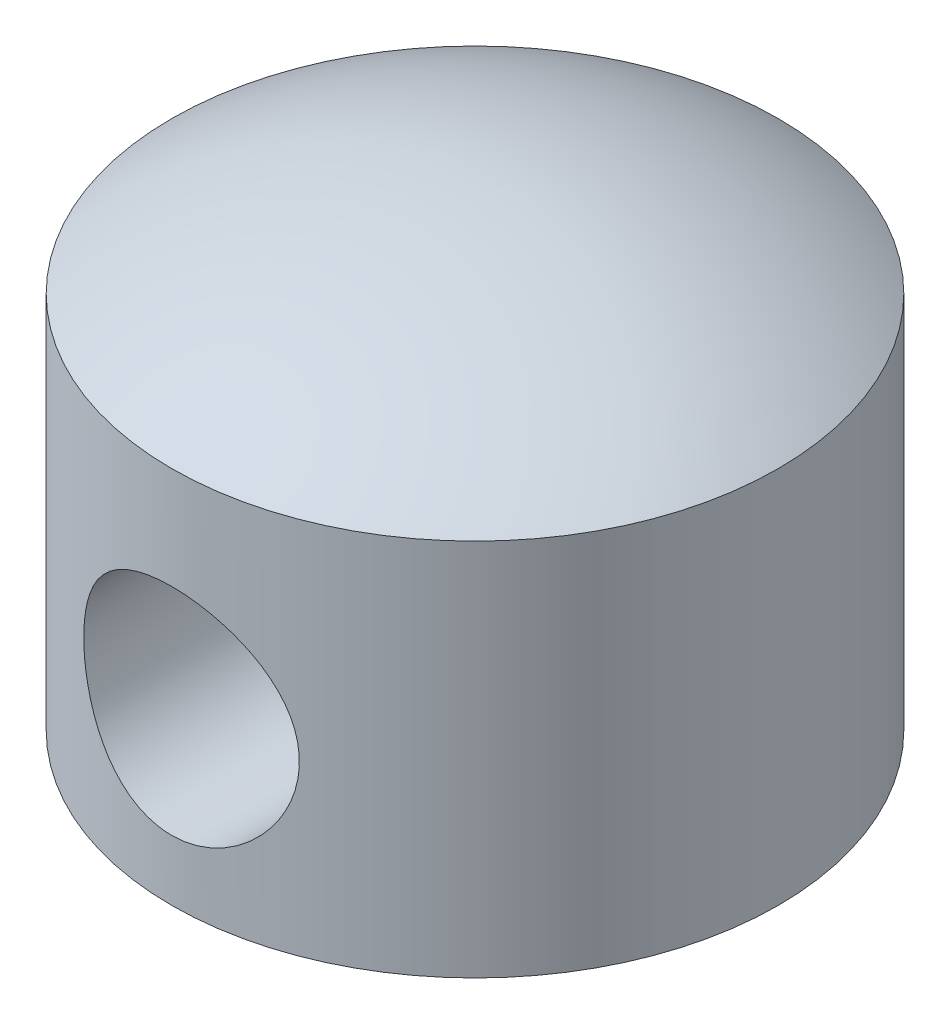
ISO-10303-21;
HEADER;
FILE_DESCRIPTION(('STEP AP214'),'2;1');
FILE_NAME('part.step','',(''),(''),'','','');
FILE_SCHEMA(('AUTOMOTIVE_DESIGN { 1 0 10303 214 1 1 1 1 }'));
ENDSEC;
DATA;
#1=APPLICATION_CONTEXT('core data for automotive mechanical design processes');
#2=APPLICATION_PROTOCOL_DEFINITION('international standard','automotive_design',2000,#1);
#3=PRODUCT_CONTEXT('',#1,'mechanical');
#4=PRODUCT('Part','Part','',(#3));
#5=PRODUCT_RELATED_PRODUCT_CATEGORY('part','',(#4));
#6=PRODUCT_DEFINITION_FORMATION('','',#4);
#7=PRODUCT_DEFINITION_CONTEXT('part definition',#1,'design');
#8=PRODUCT_DEFINITION('design','',#6,#7);
#9=PRODUCT_DEFINITION_SHAPE('','',#8);
#10=(LENGTH_UNIT() NAMED_UNIT(*) SI_UNIT(.MILLI.,.METRE.));
#11=(NAMED_UNIT(*) PLANE_ANGLE_UNIT() SI_UNIT($,.RADIAN.));
#12=(NAMED_UNIT(*) SI_UNIT($,.STERADIAN.) SOLID_ANGLE_UNIT());
#13=UNCERTAINTY_MEASURE_WITH_UNIT(LENGTH_MEASURE(1.E-05),#10,'distance_accuracy_value','');
#14=(GEOMETRIC_REPRESENTATION_CONTEXT(3) GLOBAL_UNCERTAINTY_ASSIGNED_CONTEXT((#13)) GLOBAL_UNIT_ASSIGNED_CONTEXT((#10,
#11,#12)) REPRESENTATION_CONTEXT('',''));
#15=CARTESIAN_POINT('',(0.,0.,0.));
#16=DIRECTION('',(0.,0.,1.));
#17=DIRECTION('',(1.,0.,0.));
#18=AXIS2_PLACEMENT_3D('',#15,#16,#17);
#19=CARTESIAN_POINT('',(0.,32.5,0.));
#20=DIRECTION('',(0.,-1.,0.));
#21=DIRECTION('',(1.,0.,0.));
#22=AXIS2_PLACEMENT_3D('',#19,#20,#21);
#23=PLANE('',#22);
#24=CARTESIAN_POINT('',(0.,32.5,0.));
#25=DIRECTION('',(0.,1.,0.));
#26=DIRECTION('',(0.,0.,-1.));
#27=AXIS2_PLACEMENT_3D('',#24,#25,#26);
#28=CIRCLE('',#27,2.25);
#29=CARTESIAN_POINT('',(0.,32.5,-2.25));
#30=VERTEX_POINT('',#29);
#31=EDGE_CURVE('E211',#30,#30,#28,.T.);
#32=ORIENTED_EDGE('',*,*,#31,.F.);
#33=EDGE_LOOP('',(#32));
#34=FACE_BOUND('',#33,.T.);
#35=ADVANCED_FACE('F16',(#34),#23,.T.);
#36=CARTESIAN_POINT('',(0.,34.5,0.));
#37=DIRECTION('',(0.,-1.,0.));
#38=DIRECTION('',(1.,0.,0.));
#39=AXIS2_PLACEMENT_3D('',#36,#37,#38);
#40=PLANE('',#39);
#41=CARTESIAN_POINT('',(0.,34.5,0.));
#42=DIRECTION('',(0.,-1.,0.));
#43=DIRECTION('',(0.,0.,-1.));
#44=AXIS2_PLACEMENT_3D('',#41,#42,#43);
#45=CIRCLE('',#44,0.86143593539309);
#46=CARTESIAN_POINT('',(-0.278388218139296,34.5,0.815212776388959));
#47=VERTEX_POINT('',#46);
#48=CARTESIAN_POINT('',(-0.278388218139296,34.5,-0.815212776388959));
#49=VERTEX_POINT('',#48);
#50=EDGE_CURVE('E29',#47,#49,#45,.T.);
#51=ORIENTED_EDGE('',*,*,#50,.F.);
#52=DIRECTION('',(0.,0.,-1.));
#53=VECTOR('',#52,1.);
#54=CARTESIAN_POINT('',(-0.278388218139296,34.5,-2.25));
#55=LINE('',#54,#53);
#56=EDGE_CURVE('E219',#47,#49,#55,.T.);
#57=ORIENTED_EDGE('',*,*,#56,.T.);
#58=EDGE_LOOP('',(#51,#57));
#59=FACE_BOUND('',#58,.T.);
#60=ADVANCED_FACE('F247',(#59),#40,.F.);
#61=CARTESIAN_POINT('',(0.,34.5,0.));
#62=DIRECTION('',(0.,-1.,0.));
#63=DIRECTION('',(1.,0.,0.));
#64=AXIS2_PLACEMENT_3D('',#61,#62,#63);
#65=PLANE('',#64);
#66=CARTESIAN_POINT('',(0.,34.5,0.));
#67=DIRECTION('',(0.,-1.,0.));
#68=DIRECTION('',(0.,0.,-1.));
#69=AXIS2_PLACEMENT_3D('',#66,#67,#68);
#70=CIRCLE('',#69,0.86143593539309);
#71=CARTESIAN_POINT('',(0.278388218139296,34.5,-0.815212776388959));
#72=VERTEX_POINT('',#71);
#73=CARTESIAN_POINT('',(0.278388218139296,34.5,0.815212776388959));
#74=VERTEX_POINT('',#73);
#75=EDGE_CURVE('E11',#72,#74,#70,.T.);
#76=ORIENTED_EDGE('',*,*,#75,.F.);
#77=DIRECTION('',(0.,0.,1.));
#78=VECTOR('',#77,1.);
#79=CARTESIAN_POINT('',(0.278388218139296,34.5,-2.25));
#80=LINE('',#79,#78);
#81=EDGE_CURVE('E97',#72,#74,#80,.T.);
#82=ORIENTED_EDGE('',*,*,#81,.T.);
#83=EDGE_LOOP('',(#76,#82));
#84=FACE_BOUND('',#83,.T.);
#85=ADVANCED_FACE('F95',(#84),#65,.F.);
#86=CARTESIAN_POINT('',(0.,-965.002649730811,0.));
#87=DIRECTION('',(0.,-1.,0.));
#88=DIRECTION('',(0.,0.,-1.));
#89=AXIS2_PLACEMENT_3D('',#86,#87,#88);
#90=CONICAL_SURFACE('',#89,1732.05080756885,1.0471975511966);
#91=CARTESIAN_POINT('',(0.,34.9973502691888,0.));
#92=VERTEX_POINT('',#91);
#93=VERTEX_LOOP('',#92);
#94=FACE_BOUND('',#93,.T.);
#95=CARTESIAN_POINT('',(-1.5764251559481E-13,34.5499999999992,0.77483339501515));
#96=CARTESIAN_POINT('',(0.0129203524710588,34.5500008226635,0.774833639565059));
#97=CARTESIAN_POINT('',(0.02584165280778,34.5496870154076,0.775038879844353));
#98=CARTESIAN_POINT('',(0.0513478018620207,34.5484499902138,0.775880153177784));
#99=CARTESIAN_POINT('',(0.0639336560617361,34.5475407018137,0.776506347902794));
#100=CARTESIAN_POINT('',(0.0887435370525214,34.5451581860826,0.778189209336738));
#101=CARTESIAN_POINT('',(0.100969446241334,34.5436977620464,0.779236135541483));
#102=CARTESIAN_POINT('',(0.125037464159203,34.5402596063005,0.781760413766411));
#103=CARTESIAN_POINT('',(0.136882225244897,34.5382934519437,0.783228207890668));
#104=CARTESIAN_POINT('',(0.160170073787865,34.5338897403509,0.786593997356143));
#105=CARTESIAN_POINT('',(0.171616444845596,34.5314624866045,0.788482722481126));
#106=CARTESIAN_POINT('',(0.194093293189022,34.5261820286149,0.792690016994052));
#107=CARTESIAN_POINT('',(0.205127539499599,34.5233378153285,0.794999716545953));
#108=CARTESIAN_POINT('',(0.226769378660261,34.5172676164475,0.800048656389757));
#109=CARTESIAN_POINT('',(0.237381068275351,34.5140493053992,0.802779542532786));
#110=CARTESIAN_POINT('',(0.258170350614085,34.5072753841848,0.808669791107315));
#111=CARTESIAN_POINT('',(0.268352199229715,34.5037261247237,0.8118214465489));
#112=CARTESIAN_POINT('',(0.278388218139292,34.5,0.81521277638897));
#113=B_SPLINE_CURVE_WITH_KNOTS('',3,(#95,#96,#97,#98,#99,#100,#101,#102,#103,#104,#105,#106,
#107,#108,#109,#110,#111,#112),.UNSPECIFIED.,.F.,.F.,(4,2,2,2,2,2,2,2,4),(0.,0.0387569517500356,
0.0766382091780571,0.113688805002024,0.149956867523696,0.185493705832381,0.220353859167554,
0.254595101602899,0.288278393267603),.UNSPECIFIED.);
#114=CARTESIAN_POINT('',(-1.59336871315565E-13,34.5500000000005,0.77483339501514));
#115=VERTEX_POINT('',#114);
#116=EDGE_CURVE('E113',#115,#74,#113,.T.);
#117=ORIENTED_EDGE('',*,*,#116,.F.);
#118=CARTESIAN_POINT('',(-0.278388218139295,34.5,0.81521277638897));
#119=CARTESIAN_POINT('',(-0.268352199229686,34.5037261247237,0.811821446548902));
#120=CARTESIAN_POINT('',(-0.258170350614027,34.5072753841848,0.808669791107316));
#121=CARTESIAN_POINT('',(-0.237381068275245,34.5140493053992,0.802779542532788));
#122=CARTESIAN_POINT('',(-0.226769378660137,34.5172676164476,0.800048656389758));
#123=CARTESIAN_POINT('',(-0.20512753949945,34.5233378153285,0.794999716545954));
#124=CARTESIAN_POINT('',(-0.194093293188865,34.526182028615,0.792690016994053));
#125=CARTESIAN_POINT('',(-0.171616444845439,34.5314624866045,0.788482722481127));
#126=CARTESIAN_POINT('',(-0.160170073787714,34.533889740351,0.786593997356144));
#127=CARTESIAN_POINT('',(-0.136882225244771,34.5382934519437,0.783228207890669));
#128=CARTESIAN_POINT('',(-0.125037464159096,34.5402596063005,0.781760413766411));
#129=CARTESIAN_POINT('',(-0.100969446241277,34.5436977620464,0.779236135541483));
#130=CARTESIAN_POINT('',(-0.0887435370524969,34.5451581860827,0.778189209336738));
#131=CARTESIAN_POINT('',(-0.0639336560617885,34.5475407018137,0.776506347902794));
#132=CARTESIAN_POINT('',(-0.0513478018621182,34.5484499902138,0.775880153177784));
#133=CARTESIAN_POINT('',(-0.02584165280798,34.5496870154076,0.775038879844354));
#134=CARTESIAN_POINT('',(-0.0129203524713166,34.5500008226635,0.774833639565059));
#135=CARTESIAN_POINT('',(-1.5764251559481E-13,34.5499999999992,0.77483339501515));
#136=B_SPLINE_CURVE_WITH_KNOTS('',3,(#118,#119,#120,#121,#122,#123,#124,#125,#126,#127,#128,
#129,#130,#131,#132,#133,#134,#135),.UNSPECIFIED.,.F.,.F.,(4,2,2,2,2,2,2,2,4),(0.,
0.0336832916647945,0.0679245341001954,0.102784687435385,0.138321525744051,0.174589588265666,
0.211640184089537,0.249521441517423,0.288278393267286),.UNSPECIFIED.);
#137=EDGE_CURVE('E121',#47,#115,#136,.T.);
#138=ORIENTED_EDGE('',*,*,#137,.F.);
#139=ORIENTED_EDGE('',*,*,#50,.T.);
#140=CARTESIAN_POINT('',(1.58549001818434E-13,34.5499999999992,-0.77483339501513));
#141=CARTESIAN_POINT('',(-0.0129203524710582,34.5500008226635,-0.774833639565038));
#142=CARTESIAN_POINT('',(-0.0258416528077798,34.5496870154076,-0.775038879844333));
#143=CARTESIAN_POINT('',(-0.0513478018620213,34.5484499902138,-0.775880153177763));
#144=CARTESIAN_POINT('',(-0.063933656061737,34.5475407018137,-0.776506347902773));
#145=CARTESIAN_POINT('',(-0.0887435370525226,34.5451581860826,-0.778189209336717));
#146=CARTESIAN_POINT('',(-0.100969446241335,34.5436977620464,-0.779236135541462));
#147=CARTESIAN_POINT('',(-0.125037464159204,34.5402596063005,-0.781760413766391));
#148=CARTESIAN_POINT('',(-0.136882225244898,34.5382934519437,-0.783228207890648));
#149=CARTESIAN_POINT('',(-0.160170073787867,34.5338897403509,-0.786593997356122));
#150=CARTESIAN_POINT('',(-0.171616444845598,34.5314624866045,-0.788482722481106));
#151=CARTESIAN_POINT('',(-0.194093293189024,34.5261820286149,-0.792690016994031));
#152=CARTESIAN_POINT('',(-0.205127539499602,34.5233378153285,-0.794999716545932));
#153=CARTESIAN_POINT('',(-0.226769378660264,34.5172676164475,-0.800048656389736));
#154=CARTESIAN_POINT('',(-0.237381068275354,34.5140493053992,-0.802779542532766));
#155=CARTESIAN_POINT('',(-0.258170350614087,34.5072753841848,-0.808669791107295));
#156=CARTESIAN_POINT('',(-0.268352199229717,34.5037261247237,-0.81182144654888));
#157=CARTESIAN_POINT('',(-0.278388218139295,34.5,-0.81521277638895));
#158=B_SPLINE_CURVE_WITH_KNOTS('',3,(#140,#141,#142,#143,#144,#145,#146,#147,#148,#149,#150,
#151,#152,#153,#154,#155,#156,#157),.UNSPECIFIED.,.F.,.F.,(4,2,2,2,2,2,2,2,4),(0.,
0.0387569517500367,0.0766382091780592,0.113688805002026,0.149956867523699,0.185493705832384,
0.220353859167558,0.254595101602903,0.288278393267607),.UNSPECIFIED.);
#159=CARTESIAN_POINT('',(1.59431761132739E-13,34.5500000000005,-0.77483339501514));
#160=VERTEX_POINT('',#159);
#161=EDGE_CURVE('E104',#160,#49,#158,.T.);
#162=ORIENTED_EDGE('',*,*,#161,.F.);
#163=CARTESIAN_POINT('',(0.278388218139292,34.5,-0.81521277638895));
#164=CARTESIAN_POINT('',(0.268352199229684,34.5037261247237,-0.811821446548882));
#165=CARTESIAN_POINT('',(0.258170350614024,34.5072753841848,-0.808669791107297));
#166=CARTESIAN_POINT('',(0.237381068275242,34.5140493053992,-0.802779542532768));
#167=CARTESIAN_POINT('',(0.226769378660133,34.5172676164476,-0.800048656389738));
#168=CARTESIAN_POINT('',(0.205127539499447,34.5233378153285,-0.794999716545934));
#169=CARTESIAN_POINT('',(0.194093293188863,34.526182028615,-0.792690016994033));
#170=CARTESIAN_POINT('',(0.171616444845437,34.5314624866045,-0.788482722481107));
#171=CARTESIAN_POINT('',(0.160170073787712,34.533889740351,-0.786593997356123));
#172=CARTESIAN_POINT('',(0.136882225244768,34.5382934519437,-0.783228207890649));
#173=CARTESIAN_POINT('',(0.125037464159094,34.5402596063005,-0.781760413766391));
#174=CARTESIAN_POINT('',(0.100969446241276,34.5436977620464,-0.779236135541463));
#175=CARTESIAN_POINT('',(0.0887435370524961,34.5451581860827,-0.778189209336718));
#176=CARTESIAN_POINT('',(0.0639336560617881,34.5475407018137,-0.776506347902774));
#177=CARTESIAN_POINT('',(0.0513478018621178,34.5484499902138,-0.775880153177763));
#178=CARTESIAN_POINT('',(0.0258416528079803,34.5496870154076,-0.775038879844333));
#179=CARTESIAN_POINT('',(0.0129203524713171,34.5500008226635,-0.774833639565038));
#180=CARTESIAN_POINT('',(1.58549001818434E-13,34.5499999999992,-0.77483339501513));
#181=B_SPLINE_CURVE_WITH_KNOTS('',3,(#163,#164,#165,#166,#167,#168,#169,#170,#171,#172,#173,
#174,#175,#176,#177,#178,#179,#180),.UNSPECIFIED.,.F.,.F.,(4,2,2,2,2,2,2,2,4),(0.,
0.0336832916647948,0.0679245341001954,0.102784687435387,0.138321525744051,0.174589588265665,
0.211640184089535,0.249521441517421,0.288278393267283),.UNSPECIFIED.);
#182=EDGE_CURVE('E100',#72,#160,#181,.T.);
#183=ORIENTED_EDGE('',*,*,#182,.F.);
#184=ORIENTED_EDGE('',*,*,#75,.T.);
#185=EDGE_LOOP('',(#117,#138,#139,#162,#183,#184));
#186=FACE_BOUND('',#185,.T.);
#187=ADVANCED_FACE('F102',(#94,#186),#90,.F.);
#188=CARTESIAN_POINT('',(0.,33.7499999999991,-2.25));
#189=DIRECTION('',(0.,0.,1.));
#190=DIRECTION('',(0.,-1.,0.));
#191=AXIS2_PLACEMENT_3D('',#188,#189,#190);
#192=CYLINDRICAL_SURFACE('',#191,0.8);
#193=ORIENTED_EDGE('',*,*,#137,.T.);
#194=ORIENTED_EDGE('',*,*,#116,.T.);
#195=ORIENTED_EDGE('',*,*,#81,.F.);
#196=ORIENTED_EDGE('',*,*,#182,.T.);
#197=ORIENTED_EDGE('',*,*,#161,.T.);
#198=ORIENTED_EDGE('',*,*,#56,.F.);
#199=EDGE_LOOP('',(#193,#194,#195,#196,#197,#198));
#200=FACE_BOUND('',#199,.T.);
#201=CARTESIAN_POINT('',(0.,32.9499999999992,2.25));
#202=CARTESIAN_POINT('',(0.0125886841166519,32.9499996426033,2.24999993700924));
#203=CARTESIAN_POINT('',(0.02517717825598,32.9502971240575,2.24988822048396));
#204=CARTESIAN_POINT('',(0.0504928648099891,32.9514932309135,2.24944708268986));
#205=CARTESIAN_POINT('',(0.0632196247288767,32.9523999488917,2.24911473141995));
#206=CARTESIAN_POINT('',(0.0887813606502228,32.9548364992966,2.24823237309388));
#207=CARTESIAN_POINT('',(0.10161544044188,32.9563746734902,2.24767945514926));
#208=CARTESIAN_POINT('',(0.127359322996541,32.9600942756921,2.24635596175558));
#209=CARTESIAN_POINT('',(0.140267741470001,32.9622842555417,2.24558249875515));
#210=CARTESIAN_POINT('',(0.166125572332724,32.9673262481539,2.2438177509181));
#211=CARTESIAN_POINT('',(0.179073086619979,32.9701869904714,2.24282360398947));
#212=CARTESIAN_POINT('',(0.204972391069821,32.9765876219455,2.2406180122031));
#213=CARTESIAN_POINT('',(0.217921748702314,32.980136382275,2.23940374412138));
#214=CARTESIAN_POINT('',(0.243785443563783,32.9879280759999,2.23675576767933));
#215=CARTESIAN_POINT('',(0.256696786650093,32.9921799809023,2.23531924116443));
#216=CARTESIAN_POINT('',(0.282445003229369,33.001391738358,2.23223475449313));
#217=CARTESIAN_POINT('',(0.295278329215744,33.0063606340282,2.23058412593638));
#218=CARTESIAN_POINT('',(0.316956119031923,33.0154022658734,2.22757702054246));
#219=CARTESIAN_POINT('',(0.325875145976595,33.0193153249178,2.2262746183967));
#220=CARTESIAN_POINT('',(0.344418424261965,33.0278572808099,2.22343862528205));
#221=CARTESIAN_POINT('',(0.354026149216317,33.0325187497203,2.22189488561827));
#222=CARTESIAN_POINT('',(0.373885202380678,33.0426493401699,2.21857997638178));
#223=CARTESIAN_POINT('',(0.384117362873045,33.048153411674,2.21680080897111));
#224=CARTESIAN_POINT('',(0.405150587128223,33.0600646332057,2.21301196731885));
#225=CARTESIAN_POINT('',(0.415929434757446,33.0665088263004,2.21099535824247));
#226=CARTESIAN_POINT('',(0.43796749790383,33.0803980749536,2.20673102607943));
#227=CARTESIAN_POINT('',(0.449201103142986,33.0878819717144,2.20447737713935));
#228=CARTESIAN_POINT('',(0.472044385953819,33.103948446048,2.19973816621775));
#229=CARTESIAN_POINT('',(0.483624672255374,33.1125712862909,2.1972474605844));
#230=CARTESIAN_POINT('',(0.50704115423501,33.1310123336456,2.19203257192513));
#231=CARTESIAN_POINT('',(0.5188438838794,33.140871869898,2.18930382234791));
#232=CARTESIAN_POINT('',(0.53636712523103,33.1563881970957,2.18510180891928));
#233=CARTESIAN_POINT('',(0.542304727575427,33.1618077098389,2.18365020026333));
#234=CARTESIAN_POINT('',(0.554184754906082,33.1729837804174,2.18068460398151));
#235=CARTESIAN_POINT('',(0.560122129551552,33.1787455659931,2.17917004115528));
#236=CARTESIAN_POINT('',(0.572093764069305,33.1907291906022,2.17606691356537));
#237=CARTESIAN_POINT('',(0.57811915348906,33.1969598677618,2.174478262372));
#238=CARTESIAN_POINT('',(0.589767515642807,33.2094036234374,2.17137143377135));
#239=CARTESIAN_POINT('',(0.59539720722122,33.2156102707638,2.1698526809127));
#240=CARTESIAN_POINT('',(0.606268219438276,33.2279805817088,2.16688075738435));
#241=CARTESIAN_POINT('',(0.61151623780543,33.2341382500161,2.16542714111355));
#242=CARTESIAN_POINT('',(0.621639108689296,33.2463873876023,2.16258684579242));
#243=CARTESIAN_POINT('',(0.62652059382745,33.2524732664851,2.16119964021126));
#244=CARTESIAN_POINT('',(0.640360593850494,33.270255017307,2.15721510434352));
#245=CARTESIAN_POINT('',(0.649090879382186,33.2821342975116,2.15463688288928));
#246=CARTESIAN_POINT('',(0.665223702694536,33.3054082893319,2.14974997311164));
#247=CARTESIAN_POINT('',(0.672676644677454,33.3167670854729,2.14743608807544));
#248=CARTESIAN_POINT('',(0.686386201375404,33.3388695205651,2.14307817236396));
#249=CARTESIAN_POINT('',(0.692690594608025,33.3495823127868,2.1410280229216));
#250=CARTESIAN_POINT('',(0.70423135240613,33.3702828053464,2.13719961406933));
#251=CARTESIAN_POINT('',(0.709512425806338,33.3802442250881,2.13541389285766));
#252=CARTESIAN_POINT('',(0.719129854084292,33.3993513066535,2.13211285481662));
#253=CARTESIAN_POINT('',(0.723507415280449,33.4084746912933,2.13058868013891));
#254=CARTESIAN_POINT('',(0.731434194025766,33.4258329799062,2.12782184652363));
#255=CARTESIAN_POINT('',(0.735020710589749,33.4340489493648,2.12656699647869));
#256=CARTESIAN_POINT('',(0.743787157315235,33.4550903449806,2.12350353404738));
#257=CARTESIAN_POINT('',(0.748779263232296,33.4680045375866,2.1217626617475));
#258=CARTESIAN_POINT('',(0.758018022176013,33.4938858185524,2.11850722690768));
#259=CARTESIAN_POINT('',(0.762275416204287,33.506848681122,2.1169894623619));
#260=CARTESIAN_POINT('',(0.770063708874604,33.5327853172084,2.11419232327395));
#261=CARTESIAN_POINT('',(0.773605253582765,33.5457555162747,2.11290948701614));
#262=CARTESIAN_POINT('',(0.779981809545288,33.5716647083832,2.11057913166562));
#263=CARTESIAN_POINT('',(0.782827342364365,33.584600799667,2.10952813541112));
#264=CARTESIAN_POINT('',(0.787834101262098,33.6104030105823,2.10766234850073));
#265=CARTESIAN_POINT('',(0.790005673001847,33.6232668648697,2.1068440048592));
#266=CARTESIAN_POINT('',(0.793688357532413,33.6488883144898,2.10544336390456));
#267=CARTESIAN_POINT('',(0.795209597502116,33.6616442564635,2.10485745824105));
#268=CARTESIAN_POINT('',(0.797616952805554,33.6870163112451,2.10392183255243));
#269=CARTESIAN_POINT('',(0.798512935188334,33.6996313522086,2.10356844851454));
#270=CARTESIAN_POINT('',(0.799696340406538,33.7246906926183,2.10309781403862));
#271=CARTESIAN_POINT('',(0.799993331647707,33.7371344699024,2.10297685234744));
#272=CARTESIAN_POINT('',(0.800006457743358,33.7620442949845,2.1029713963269));
#273=CARTESIAN_POINT('',(0.799721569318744,33.7745103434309,2.10308731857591));
#274=CARTESIAN_POINT('',(0.798560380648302,33.7996169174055,2.10354916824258));
#275=CARTESIAN_POINT('',(0.797674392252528,33.8122569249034,2.1038988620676));
#276=CARTESIAN_POINT('',(0.795284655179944,33.8376814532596,2.10482822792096));
#277=CARTESIAN_POINT('',(0.793770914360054,33.8504648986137,2.10541161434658));
#278=CARTESIAN_POINT('',(0.790100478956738,33.8761436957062,2.10680838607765));
#279=CARTESIAN_POINT('',(0.787933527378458,33.8890373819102,2.10762542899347));
#280=CARTESIAN_POINT('',(0.782932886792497,33.914901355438,2.10948977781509));
#281=CARTESIAN_POINT('',(0.780088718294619,33.9278693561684,2.11054068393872));
#282=CARTESIAN_POINT('',(0.773711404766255,33.9538441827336,2.11287200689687));
#283=CARTESIAN_POINT('',(0.770167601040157,33.9668480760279,2.11415594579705));
#284=CARTESIAN_POINT('',(0.762370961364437,33.9928535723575,2.11695652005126));
#285=CARTESIAN_POINT('',(0.758107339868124,34.0058515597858,2.11847666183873));
#286=CARTESIAN_POINT('',(0.748851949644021,34.0318042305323,2.12173777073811));
#287=CARTESIAN_POINT('',(0.743849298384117,34.0447546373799,2.12348197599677));
#288=CARTESIAN_POINT('',(0.735071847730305,34.0658320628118,2.12654918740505));
#289=CARTESIAN_POINT('',(0.731486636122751,34.0740486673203,2.12780365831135));
#290=CARTESIAN_POINT('',(0.723558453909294,34.0914174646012,2.13057155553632));
#291=CARTESIAN_POINT('',(0.719177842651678,34.1005505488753,2.13209733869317));
#292=CARTESIAN_POINT('',(0.709549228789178,34.1196857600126,2.13540330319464));
#293=CARTESIAN_POINT('',(0.704259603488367,34.1296653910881,2.13719243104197));
#294=CARTESIAN_POINT('',(0.692695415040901,34.1504102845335,2.1410294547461));
#295=CARTESIAN_POINT('',(0.686375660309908,34.161148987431,2.14308488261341));
#296=CARTESIAN_POINT('',(0.672627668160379,34.183310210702,2.14745515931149));
#297=CARTESIAN_POINT('',(0.665151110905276,34.1947015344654,2.1497761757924));
#298=CARTESIAN_POINT('',(0.648961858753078,34.2180462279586,2.15467917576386));
#299=CARTESIAN_POINT('',(0.640198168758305,34.2299632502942,2.15726639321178));
#300=CARTESIAN_POINT('',(0.626302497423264,34.2478017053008,2.16126512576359));
#301=CARTESIAN_POINT('',(0.621400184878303,34.2539078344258,2.16265752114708));
#302=CARTESIAN_POINT('',(0.611232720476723,34.2661981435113,2.16550866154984));
#303=CARTESIAN_POINT('',(0.605960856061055,34.2723766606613,2.16696793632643));
#304=CARTESIAN_POINT('',(0.595039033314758,34.2847890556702,2.16995163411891));
#305=CARTESIAN_POINT('',(0.589382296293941,34.2910168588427,2.17147650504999));
#306=CARTESIAN_POINT('',(0.5776765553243,34.3035030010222,2.17459605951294));
#307=CARTESIAN_POINT('',(0.571620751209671,34.309754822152,2.1761913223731));
#308=CARTESIAN_POINT('',(0.5596225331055,34.3217436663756,2.17929838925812));
#309=CARTESIAN_POINT('',(0.553690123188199,34.3274906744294,2.18081029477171));
#310=CARTESIAN_POINT('',(0.541819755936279,34.3386388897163,2.18377078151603));
#311=CARTESIAN_POINT('',(0.535886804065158,34.344045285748,2.18521993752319));
#312=CARTESIAN_POINT('',(0.518375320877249,34.35952643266,2.18941533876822));
#313=CARTESIAN_POINT('',(0.5065803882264,34.3693643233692,2.19213980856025));
#314=CARTESIAN_POINT('',(0.483176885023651,34.3877679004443,2.19734697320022));
#315=CARTESIAN_POINT('',(0.471601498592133,34.3963746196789,2.19983423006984));
#316=CARTESIAN_POINT('',(0.448764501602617,34.4124138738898,2.20456738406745));
#317=CARTESIAN_POINT('',(0.437532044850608,34.4198863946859,2.20681841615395));
#318=CARTESIAN_POINT('',(0.415492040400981,34.4337571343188,2.21107835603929));
#319=CARTESIAN_POINT('',(0.404709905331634,34.4401939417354,2.21309317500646));
#320=CARTESIAN_POINT('',(0.383665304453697,34.4520938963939,2.21687929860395));
#321=CARTESIAN_POINT('',(0.373424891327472,34.4575938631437,2.21865751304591));
#322=CARTESIAN_POINT('',(0.353544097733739,34.4677190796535,2.22197134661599));
#323=CARTESIAN_POINT('',(0.343922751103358,34.4723790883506,2.22351492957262));
#324=CARTESIAN_POINT('',(0.325346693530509,34.4809203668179,2.22635158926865));
#325=CARTESIAN_POINT('',(0.316408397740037,34.4848340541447,2.22765474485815));
#326=CARTESIAN_POINT('',(0.294736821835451,34.4938535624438,2.23065587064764));
#327=CARTESIAN_POINT('',(0.281930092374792,34.4988017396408,2.23230048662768));
#328=CARTESIAN_POINT('',(0.256234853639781,34.5079757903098,2.2353736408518));
#329=CARTESIAN_POINT('',(0.24334984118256,34.5122105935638,2.23680481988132));
#330=CARTESIAN_POINT('',(0.217538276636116,34.5199715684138,2.23944298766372));
#331=CARTESIAN_POINT('',(0.204614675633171,34.5235065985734,2.24065276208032));
#332=CARTESIAN_POINT('',(0.178766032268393,34.5298830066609,2.24285020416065));
#333=CARTESIAN_POINT('',(0.165843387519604,34.5327331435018,2.24384066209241));
#334=CARTESIAN_POINT('',(0.140034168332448,34.5377568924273,2.24559888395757));
#335=CARTESIAN_POINT('',(0.127149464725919,34.5399391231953,2.24636947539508));
#336=CARTESIAN_POINT('',(0.101451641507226,34.5436459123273,2.24768807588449));
#337=CARTESIAN_POINT('',(0.0886398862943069,34.5451789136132,2.24823893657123));
#338=CARTESIAN_POINT('',(0.0631212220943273,34.5476075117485,2.24911803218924));
#339=CARTESIAN_POINT('',(0.0504151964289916,34.5485113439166,2.2494491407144));
#340=CARTESIAN_POINT('',(0.0251392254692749,34.5497037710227,2.24988864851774));
#341=CARTESIAN_POINT('',(0.0125697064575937,34.5500003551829,2.24999993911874));
#342=CARTESIAN_POINT('',(0.,34.5499999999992,2.25));
#343=B_SPLINE_CURVE_WITH_KNOTS('',3,(#201,#202,#203,#204,#205,#206,#207,#208,#209,#210,#211,
#212,#213,#214,#215,#216,#217,#218,#219,#220,#221,#222,#223,#224,#225,#226,#227,#228,#229,#230,
#231,#232,#233,#234,#235,#236,#237,#238,#239,#240,#241,#242,#243,#244,#245,#246,#247,#248,#249,
#250,#251,#252,#253,#254,#255,#256,#257,#258,#259,#260,#261,#262,#263,#264,#265,#266,#267,#268,
#269,#270,#271,#272,#273,#274,#275,#276,#277,#278,#279,#280,#281,#282,#283,#284,#285,#286,#287,
#288,#289,#290,#291,#292,#293,#294,#295,#296,#297,#298,#299,#300,#301,#302,#303,#304,#305,#306,
#307,#308,#309,#310,#311,#312,#313,#314,#315,#316,#317,#318,#319,#320,#321,#322,#323,#324,#325,
#326,#327,#328,#329,#330,#331,#332,#333,#334,#335,#336,#337,#338,#339,#340,#341,#342),
.UNSPECIFIED.,.F.,.F.,(4,2,2,2,2,2,2,2,2,2,2,2,2,2,2,2,2,2,2,2,2,2,2,2,2,2,2,2,2,2,2,2,2,2,2,2,
2,2,2,2,2,2,2,2,2,2,2,2,2,2,2,2,2,2,2,2,2,2,2,2,2,2,2,2,2,2,2,2,2,2,4),(0.,0.0377617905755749,
0.07603536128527,0.114831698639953,0.154161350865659,0.194034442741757,0.234460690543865,
0.275449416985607,0.317009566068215,0.346482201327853,0.378842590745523,0.414093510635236,
0.45223707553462,0.493274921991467,0.537208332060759,0.584038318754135,0.608542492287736,
0.633771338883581,0.660202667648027,0.685746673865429,0.710403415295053,0.734172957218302,
0.779046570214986,0.82037330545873,0.858153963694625,0.892389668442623,0.923082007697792,
0.95023326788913,0.99207520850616,1.0332411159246,1.07374054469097,1.11358352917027,
1.15278060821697,1.1913428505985,1.22928188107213,1.26660990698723,1.30400363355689,
1.34201483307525,1.38065582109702,1.41993832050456,1.45987348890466,1.5004719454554,
1.54174379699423,1.5836986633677,1.61084994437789,1.64157283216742,1.67586962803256,
1.71374192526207,1.75519084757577,1.80021719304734,1.82407458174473,1.84882680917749,
1.87447394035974,1.90101603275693,1.92620259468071,1.95066923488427,1.99743843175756,
2.04133006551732,2.08234516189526,2.12048501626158,2.1557512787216,2.18814607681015,
2.21767219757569,2.25913420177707,2.30003079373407,2.3403708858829,2.3801637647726,
2.41941910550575,2.45814698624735,2.49635790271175,2.53406278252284),.UNSPECIFIED.);
#344=CARTESIAN_POINT('',(0.,32.9499999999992,2.25));
#345=VERTEX_POINT('',#344);
#346=CARTESIAN_POINT('',(0.,34.5499999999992,2.25));
#347=VERTEX_POINT('',#346);
#348=EDGE_CURVE('E265',#345,#347,#343,.T.);
#349=ORIENTED_EDGE('',*,*,#348,.T.);
#350=CARTESIAN_POINT('',(0.,34.5499999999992,2.25));
#351=CARTESIAN_POINT('',(-0.0125756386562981,34.5500003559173,2.24999993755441));
#352=CARTESIAN_POINT('',(-0.0251510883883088,34.5497034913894,2.24988846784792));
#353=CARTESIAN_POINT('',(-0.0504401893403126,34.5485098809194,2.24944829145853));
#354=CARTESIAN_POINT('',(-0.0631534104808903,34.5476050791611,2.24911666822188));
#355=CARTESIAN_POINT('',(-0.0886876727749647,34.5451737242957,2.24823623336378));
#356=CARTESIAN_POINT('',(-0.101507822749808,34.5436388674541,2.24768452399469));
#357=CARTESIAN_POINT('',(-0.127223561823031,34.5399273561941,2.24636391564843));
#358=CARTESIAN_POINT('',(-0.140117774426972,34.5377421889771,2.24559214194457));
#359=CARTESIAN_POINT('',(-0.165947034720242,34.5327113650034,2.24383124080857));
#360=CARTESIAN_POINT('',(-0.178880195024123,34.5298570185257,2.24283926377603));
#361=CARTESIAN_POINT('',(-0.204750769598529,34.5234708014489,2.24063848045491));
#362=CARTESIAN_POINT('',(-0.217685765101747,34.5199301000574,2.23942686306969));
#363=CARTESIAN_POINT('',(-0.243520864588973,34.5121562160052,2.23678465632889));
#364=CARTESIAN_POINT('',(-0.256417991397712,34.5079141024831,2.23535126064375));
#365=CARTESIAN_POINT('',(-0.282138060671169,34.4987236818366,2.23227350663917));
#366=CARTESIAN_POINT('',(-0.294957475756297,34.4937663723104,2.23062649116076));
#367=CARTESIAN_POINT('',(-0.31663361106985,34.4847369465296,2.22762292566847));
#368=CARTESIAN_POINT('',(-0.325564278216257,34.4808233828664,2.22632010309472));
#369=CARTESIAN_POINT('',(-0.344131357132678,34.4722797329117,2.22348296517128));
#370=CARTESIAN_POINT('',(-0.353751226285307,34.4676170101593,2.22193847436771));
#371=CARTESIAN_POINT('',(-0.373634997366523,34.4574830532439,2.21862176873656));
#372=CARTESIAN_POINT('',(-0.383879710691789,34.451976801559,2.21684153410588));
#373=CARTESIAN_POINT('',(-0.404938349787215,34.4400601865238,2.21305025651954));
#374=CARTESIAN_POINT('',(-0.41573003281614,34.4336127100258,2.21103225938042));
#375=CARTESIAN_POINT('',(-0.437793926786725,34.4197156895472,2.20676484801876));
#376=CARTESIAN_POINT('',(-0.449040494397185,34.4122272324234,2.2045094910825));
#377=CARTESIAN_POINT('',(-0.471909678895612,34.3961502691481,2.19976655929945));
#378=CARTESIAN_POINT('',(-0.483502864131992,34.3875214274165,2.19727382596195));
#379=CARTESIAN_POINT('',(-0.506944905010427,34.3690668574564,2.19205457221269));
#380=CARTESIAN_POINT('',(-0.518760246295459,34.3591997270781,2.18932347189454));
#381=CARTESIAN_POINT('',(-0.53630181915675,34.3436709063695,2.18511774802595));
#382=CARTESIAN_POINT('',(-0.542245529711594,34.3382469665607,2.18366484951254));
#383=CARTESIAN_POINT('',(-0.5541376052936,34.3270616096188,2.18069658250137));
#384=CARTESIAN_POINT('',(-0.560080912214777,34.3212949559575,2.17918063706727));
#385=CARTESIAN_POINT('',(-0.572068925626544,34.3092964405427,2.17607349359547));
#386=CARTESIAN_POINT('',(-0.578104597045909,34.3030555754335,2.17448220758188));
#387=CARTESIAN_POINT('',(-0.589772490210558,34.2905911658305,2.17137028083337));
#388=CARTESIAN_POINT('',(-0.595411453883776,34.2843740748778,2.16984906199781));
#389=CARTESIAN_POINT('',(-0.606300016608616,34.2719826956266,2.16687235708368));
#390=CARTESIAN_POINT('',(-0.611556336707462,34.265814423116,2.16541642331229));
#391=CARTESIAN_POINT('',(-0.621694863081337,34.2535439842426,2.16257164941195));
#392=CARTESIAN_POINT('',(-0.626583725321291,34.2474474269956,2.16118228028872));
#393=CARTESIAN_POINT('',(-0.64044407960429,34.2296342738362,2.15719161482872));
#394=CARTESIAN_POINT('',(-0.649186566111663,34.2177336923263,2.15460951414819));
#395=CARTESIAN_POINT('',(-0.665340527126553,34.1944175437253,2.14971548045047));
#396=CARTESIAN_POINT('',(-0.672802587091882,34.1830380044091,2.14739832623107));
#397=CARTESIAN_POINT('',(-0.686527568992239,34.1608949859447,2.1430345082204));
#398=CARTESIAN_POINT('',(-0.692838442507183,34.150162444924,2.14098169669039));
#399=CARTESIAN_POINT('',(-0.704389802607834,34.129423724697,2.13714860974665));
#400=CARTESIAN_POINT('',(-0.709675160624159,34.119443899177,2.13536083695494));
#401=CARTESIAN_POINT('',(-0.719299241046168,34.1003015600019,2.13205633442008));
#402=CARTESIAN_POINT('',(-0.723679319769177,34.0911613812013,2.13053070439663));
#403=CARTESIAN_POINT('',(-0.731609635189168,34.0737712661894,2.1277616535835));
#404=CARTESIAN_POINT('',(-0.735197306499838,34.0655403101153,2.12650598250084));
#405=CARTESIAN_POINT('',(-0.743959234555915,34.0444755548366,2.12344320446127));
#406=CARTESIAN_POINT('',(-0.748945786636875,34.0315531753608,2.12170387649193));
#407=CARTESIAN_POINT('',(-0.758173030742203,34.0056552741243,2.11845179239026));
#408=CARTESIAN_POINT('',(-0.762424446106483,33.9926839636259,2.1169358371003));
#409=CARTESIAN_POINT('',(-0.770200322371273,33.9667301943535,2.11414262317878));
#410=CARTESIAN_POINT('',(-0.773735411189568,33.9537512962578,2.11286190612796));
#411=CARTESIAN_POINT('',(-0.780098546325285,33.927824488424,2.11053608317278));
#412=CARTESIAN_POINT('',(-0.782937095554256,33.9148794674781,2.10948750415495));
#413=CARTESIAN_POINT('',(-0.787929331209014,33.8890592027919,2.10762684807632));
#414=CARTESIAN_POINT('',(-0.790093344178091,33.8761862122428,2.10681122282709));
#415=CARTESIAN_POINT('',(-0.793760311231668,33.8505463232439,2.10541631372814));
#416=CARTESIAN_POINT('',(-0.795273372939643,33.8377810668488,2.10483342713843));
#417=CARTESIAN_POINT('',(-0.79766373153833,33.8123902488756,2.10390413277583));
#418=CARTESIAN_POINT('',(-0.798550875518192,33.7997657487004,2.1035540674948));
#419=CARTESIAN_POINT('',(-0.799715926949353,33.7746873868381,2.10309036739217));
#420=CARTESIAN_POINT('',(-0.800003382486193,33.7622340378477,2.10297302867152));
#421=CARTESIAN_POINT('',(-0.799996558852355,33.7373326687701,2.10297516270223));
#422=CARTESIAN_POINT('',(-0.799702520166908,33.7248846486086,2.10309453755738));
#423=CARTESIAN_POINT('',(-0.798524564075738,33.6998144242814,2.10356265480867));
#424=CARTESIAN_POINT('',(-0.797630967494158,33.6871927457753,2.10391515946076));
#425=CARTESIAN_POINT('',(-0.795227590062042,33.6618050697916,2.10484951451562));
#426=CARTESIAN_POINT('',(-0.793707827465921,33.6490401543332,2.10543507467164));
#427=CARTESIAN_POINT('',(-0.790026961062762,33.6233985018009,2.10683556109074));
#428=CARTESIAN_POINT('',(-0.78785561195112,33.6105234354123,2.1076541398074));
#429=CARTESIAN_POINT('',(-0.782847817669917,33.5846966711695,2.10952092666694));
#430=CARTESIAN_POINT('',(-0.780000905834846,33.5717472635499,2.11057272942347));
#431=CARTESIAN_POINT('',(-0.773619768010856,33.5458094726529,2.11290521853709));
#432=CARTESIAN_POINT('',(-0.770074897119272,33.5328240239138,2.11418942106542));
#433=CARTESIAN_POINT('',(-0.762277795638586,33.5068551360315,2.11698987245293));
#434=CARTESIAN_POINT('',(-0.758014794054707,33.4938753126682,2.11850962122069));
#435=CARTESIAN_POINT('',(-0.748762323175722,33.467958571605,2.12176938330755));
#436=CARTESIAN_POINT('',(-0.743761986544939,33.4550259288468,2.1235126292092));
#437=CARTESIAN_POINT('',(-0.734988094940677,33.43397327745,2.12657808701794));
#438=CARTESIAN_POINT('',(-0.731403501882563,33.4257639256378,2.127832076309));
#439=CARTESIAN_POINT('',(-0.723478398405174,33.4084132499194,2.13059822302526));
#440=CARTESIAN_POINT('',(-0.719100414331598,33.3992909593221,2.13212266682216));
#441=CARTESIAN_POINT('',(-0.709479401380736,33.3801807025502,2.13542519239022));
#442=CARTESIAN_POINT('',(-0.704194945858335,33.3702151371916,2.13721217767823));
#443=CARTESIAN_POINT('',(-0.692644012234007,33.3495013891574,2.14104412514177));
#444=CARTESIAN_POINT('',(-0.686332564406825,33.3387796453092,2.14309658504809));
#445=CARTESIAN_POINT('',(-0.672604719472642,33.3166548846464,2.14746013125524));
#446=CARTESIAN_POINT('',(-0.665140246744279,33.3052829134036,2.14977735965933));
#447=CARTESIAN_POINT('',(-0.648979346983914,33.2819788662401,2.15467197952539));
#448=CARTESIAN_POINT('',(-0.640232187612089,33.2700829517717,2.1572545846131));
#449=CARTESIAN_POINT('',(-0.626363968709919,33.2522758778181,2.16124605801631));
#450=CARTESIAN_POINT('',(-0.62147178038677,33.2461806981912,2.16263584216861));
#451=CARTESIAN_POINT('',(-0.61132588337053,33.2339124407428,2.16548155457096));
#452=CARTESIAN_POINT('',(-0.606065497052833,33.2277449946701,2.16693801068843));
#453=CARTESIAN_POINT('',(-0.595168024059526,33.215354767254,2.16991587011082));
#454=CARTESIAN_POINT('',(-0.589524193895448,33.2091380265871,2.17143771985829));
#455=CARTESIAN_POINT('',(-0.577845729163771,33.196673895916,2.17455101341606));
#456=CARTESIAN_POINT('',(-0.571804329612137,33.1904329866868,2.17614303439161));
#457=CARTESIAN_POINT('',(-0.559820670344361,33.1784502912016,2.17924750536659));
#458=CARTESIAN_POINT('',(-0.553887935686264,33.1726990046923,2.18076005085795));
#459=CARTESIAN_POINT('',(-0.542016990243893,33.1615426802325,2.18372177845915));
#460=CARTESIAN_POINT('',(-0.536083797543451,33.1561324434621,2.18517153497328));
#461=CARTESIAN_POINT('',(-0.518572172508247,33.1406409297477,2.18936854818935));
#462=CARTESIAN_POINT('',(-0.506777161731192,33.1307965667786,2.19209408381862));
#463=CARTESIAN_POINT('',(-0.483374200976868,33.1123815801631,2.19730320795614));
#464=CARTESIAN_POINT('',(-0.47179951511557,33.1037698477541,2.19979135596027));
#465=CARTESIAN_POINT('',(-0.44896486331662,33.0877218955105,2.20452611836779));
#466=CARTESIAN_POINT('',(-0.437734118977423,33.0802456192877,2.20677786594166));
#467=CARTESIAN_POINT('',(-0.415698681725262,33.0663684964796,2.21103906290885));
#468=CARTESIAN_POINT('',(-0.404919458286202,33.0599289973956,2.21305442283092));
#469=CARTESIAN_POINT('',(-0.383881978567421,33.0480245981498,2.2168414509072));
#470=CARTESIAN_POINT('',(-0.373645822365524,33.0425228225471,2.21862003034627));
#471=CARTESIAN_POINT('',(-0.353774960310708,33.0323947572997,2.22193442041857));
#472=CARTESIAN_POINT('',(-0.344159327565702,33.0277336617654,2.22347819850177));
#473=CARTESIAN_POINT('',(-0.325596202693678,33.0191908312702,2.22631505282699));
#474=CARTESIAN_POINT('',(-0.316665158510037,33.0152766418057,2.22761821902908));
#475=CARTESIAN_POINT('',(-0.294990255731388,33.0062466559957,2.23062246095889));
#476=CARTESIAN_POINT('',(-0.282172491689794,33.0012893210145,2.23226990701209));
#477=CARTESIAN_POINT('',(-0.256454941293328,32.9920984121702,2.23534835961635));
#478=CARTESIAN_POINT('',(-0.243558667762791,32.9878558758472,2.23678201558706));
#479=CARTESIAN_POINT('',(-0.217724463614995,32.9800808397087,2.23942474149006));
#480=CARTESIAN_POINT('',(-0.204789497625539,32.9765394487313,2.24063660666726));
#481=CARTESIAN_POINT('',(-0.178918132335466,32.9701516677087,2.24283784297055));
#482=CARTESIAN_POINT('',(-0.165984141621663,32.9672964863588,2.24383001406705));
#483=CARTESIAN_POINT('',(-0.140152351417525,32.962263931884,2.24559127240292));
#484=CARTESIAN_POINT('',(-0.1272564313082,32.9600779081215,2.24636319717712));
#485=CARTESIAN_POINT('',(-0.101536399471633,32.956364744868,2.24768407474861));
#486=CARTESIAN_POINT('',(-0.0887136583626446,32.9548291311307,2.24823588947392));
#487=CARTESIAN_POINT('',(-0.0631733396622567,32.9523964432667,2.24911650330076));
#488=CARTESIAN_POINT('',(-0.0504566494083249,32.9514911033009,2.24944818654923));
#489=CARTESIAN_POINT('',(-0.0251597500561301,32.9502967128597,2.2498884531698));
#490=CARTESIAN_POINT('',(-0.0125799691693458,32.9499996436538,2.2499999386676));
#491=CARTESIAN_POINT('',(0.,32.9499999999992,2.25));
#492=B_SPLINE_CURVE_WITH_KNOTS('',3,(#350,#351,#352,#353,#354,#355,#356,#357,#358,#359,#360,
#361,#362,#363,#364,#365,#366,#367,#368,#369,#370,#371,#372,#373,#374,#375,#376,#377,#378,#379,
#380,#381,#382,#383,#384,#385,#386,#387,#388,#389,#390,#391,#392,#393,#394,#395,#396,#397,#398,
#399,#400,#401,#402,#403,#404,#405,#406,#407,#408,#409,#410,#411,#412,#413,#414,#415,#416,#417,
#418,#419,#420,#421,#422,#423,#424,#425,#426,#427,#428,#429,#430,#431,#432,#433,#434,#435,#436,
#437,#438,#439,#440,#441,#442,#443,#444,#445,#446,#447,#448,#449,#450,#451,#452,#453,#454,#455,
#456,#457,#458,#459,#460,#461,#462,#463,#464,#465,#466,#467,#468,#469,#470,#471,#472,#473,#474,
#475,#476,#477,#478,#479,#480,#481,#482,#483,#484,#485,#486,#487,#488,#489,#490,#491),
.UNSPECIFIED.,.F.,.F.,(4,2,2,2,2,2,2,2,2,2,2,2,2,2,2,2,2,2,2,2,2,2,2,2,2,2,2,2,2,2,2,2,2,2,2,2,
2,2,2,2,2,2,2,2,2,2,2,2,2,2,2,2,2,2,2,2,2,2,2,2,2,2,2,2,2,2,2,2,2,2,4),(0.,0.0377226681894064,
0.0759553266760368,0.114708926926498,0.153993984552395,0.193820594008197,0.234198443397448,
0.275136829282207,0.3166446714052,0.346149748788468,0.378544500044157,0.413831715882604,
0.452013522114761,0.493091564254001,0.537067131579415,0.583941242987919,0.608468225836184,
0.633720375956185,0.660195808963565,0.68578233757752,0.710480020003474,0.734288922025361,
0.779236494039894,0.82063087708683,0.858472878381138,0.892763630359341,0.92350473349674,
0.950698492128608,0.992556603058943,1.03374025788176,1.07425904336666,1.11412302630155,
1.15334277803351,1.1919293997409,1.22989454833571,1.26725046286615,1.30459093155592,
1.34254920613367,1.3811375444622,1.42036761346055,1.46025051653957,1.50079682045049,
1.54201658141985,1.58391937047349,1.61104997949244,1.64174005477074,1.67599188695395,
1.71380706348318,1.75518670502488,1.80013160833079,1.82394370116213,1.84864759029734,
1.87424334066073,1.90073100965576,1.92592738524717,1.95040250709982,1.99718466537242,
2.04108392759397,2.08210131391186,2.12023811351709,2.15549596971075,2.18787700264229,
2.21738399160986,2.25888743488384,2.29982387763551,2.3402022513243,2.38003186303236,
2.41932241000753,2.45808399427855,2.49632713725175,2.53406279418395),.UNSPECIFIED.);
#493=EDGE_CURVE('E60',#347,#345,#492,.T.);
#494=ORIENTED_EDGE('',*,*,#493,.T.);
#495=EDGE_LOOP('',(#349,#494));
#496=FACE_BOUND('',#495,.T.);
#497=CARTESIAN_POINT('',(0.,34.5499999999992,-2.25));
#498=CARTESIAN_POINT('',(0.0125756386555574,34.5500003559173,-2.2499999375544));
#499=CARTESIAN_POINT('',(0.0251510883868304,34.5497034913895,-2.24988846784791));
#500=CARTESIAN_POINT('',(0.0504401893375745,34.5485098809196,-2.24944829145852));
#501=CARTESIAN_POINT('',(0.0631534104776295,34.5476050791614,-2.24911666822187));
#502=CARTESIAN_POINT('',(0.0886876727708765,34.5451737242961,-2.24823623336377));
#503=CARTESIAN_POINT('',(0.101507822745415,34.5436388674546,-2.24768452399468));
#504=CARTESIAN_POINT('',(0.127223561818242,34.5399273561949,-2.24636391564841));
#505=CARTESIAN_POINT('',(0.140117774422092,34.537742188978,-2.24559214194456));
#506=CARTESIAN_POINT('',(0.165947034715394,34.5327113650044,-2.24383124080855));
#507=CARTESIAN_POINT('',(0.178880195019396,34.5298570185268,-2.24283926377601));
#508=CARTESIAN_POINT('',(0.20475076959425,34.52347080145,-2.24063848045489));
#509=CARTESIAN_POINT('',(0.217685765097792,34.5199301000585,-2.23942686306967));
#510=CARTESIAN_POINT('',(0.243520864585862,34.5121562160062,-2.23678465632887));
#511=CARTESIAN_POINT('',(0.256417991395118,34.507914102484,-2.23535126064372));
#512=CARTESIAN_POINT('',(0.282138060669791,34.4987236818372,-2.23227350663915));
#513=CARTESIAN_POINT('',(0.294957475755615,34.4937663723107,-2.23062649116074));
#514=CARTESIAN_POINT('',(0.31663361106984,34.4847369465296,-2.22762292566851));
#515=CARTESIAN_POINT('',(0.325564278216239,34.4808233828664,-2.22632010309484));
#516=CARTESIAN_POINT('',(0.344131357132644,34.4722797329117,-2.22348296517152));
#517=CARTESIAN_POINT('',(0.353751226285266,34.4676170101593,-2.22193847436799));
#518=CARTESIAN_POINT('',(0.373634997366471,34.4574830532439,-2.21862176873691));
#519=CARTESIAN_POINT('',(0.383879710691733,34.4519768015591,-2.21684153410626));
#520=CARTESIAN_POINT('',(0.404938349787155,34.4400601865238,-2.21305025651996));
#521=CARTESIAN_POINT('',(0.415730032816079,34.4336127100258,-2.21103225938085));
#522=CARTESIAN_POINT('',(0.437793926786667,34.4197156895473,-2.20676484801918));
#523=CARTESIAN_POINT('',(0.449040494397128,34.4122272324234,-2.20450949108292));
#524=CARTESIAN_POINT('',(0.471909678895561,34.3961502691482,-2.19976655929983));
#525=CARTESIAN_POINT('',(0.483502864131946,34.3875214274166,-2.1972738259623));
#526=CARTESIAN_POINT('',(0.506944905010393,34.3690668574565,-2.19205457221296));
#527=CARTESIAN_POINT('',(0.518760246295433,34.3591997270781,-2.18932347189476));
#528=CARTESIAN_POINT('',(0.536301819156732,34.3436709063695,-2.1851177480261));
#529=CARTESIAN_POINT('',(0.542245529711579,34.3382469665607,-2.18366484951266));
#530=CARTESIAN_POINT('',(0.554137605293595,34.3270616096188,-2.18069658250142));
#531=CARTESIAN_POINT('',(0.560080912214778,34.3212949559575,-2.17918063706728));
#532=CARTESIAN_POINT('',(0.572068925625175,34.309296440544,-2.17607349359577));
#533=CARTESIAN_POINT('',(0.578104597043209,34.3030555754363,-2.1744822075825));
#534=CARTESIAN_POINT('',(0.58977249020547,34.290591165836,-2.1713702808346));
#535=CARTESIAN_POINT('',(0.595411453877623,34.2843740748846,-2.16984906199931));
#536=CARTESIAN_POINT('',(0.606300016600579,34.2719826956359,-2.16687235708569));
#537=CARTESIAN_POINT('',(0.6115563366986,34.2658144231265,-2.16541642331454));
#538=CARTESIAN_POINT('',(0.621694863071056,34.2535439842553,-2.16257164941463));
#539=CARTESIAN_POINT('',(0.62658372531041,34.2474474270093,-2.16118228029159));
#540=CARTESIAN_POINT('',(0.640444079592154,34.2296342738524,-2.15719161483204));
#541=CARTESIAN_POINT('',(0.649186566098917,34.2177336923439,-2.15460951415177));
#542=CARTESIAN_POINT('',(0.665340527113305,34.1944175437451,-2.14971548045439));
#543=CARTESIAN_POINT('',(0.672802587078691,34.1830380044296,-2.14739832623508));
#544=CARTESIAN_POINT('',(0.686527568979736,34.1608949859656,-2.14303450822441));
#545=CARTESIAN_POINT('',(0.692838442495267,34.1501624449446,-2.14098169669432));
#546=CARTESIAN_POINT('',(0.70438980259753,34.1294237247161,-2.13714860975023));
#547=CARTESIAN_POINT('',(0.709675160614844,34.1194438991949,-2.13536083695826));
#548=CARTESIAN_POINT('',(0.719299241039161,34.1003015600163,-2.13205633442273));
#549=CARTESIAN_POINT('',(0.723679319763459,34.0911613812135,-2.13053070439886));
#550=CARTESIAN_POINT('',(0.731609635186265,34.0737712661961,-2.12776165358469));
#551=CARTESIAN_POINT('',(0.735197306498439,34.0655403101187,-2.12650598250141));
#552=CARTESIAN_POINT('',(0.743959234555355,34.044475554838,-2.12344320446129));
#553=CARTESIAN_POINT('',(0.748945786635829,34.0315531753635,-2.1217038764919));
#554=CARTESIAN_POINT('',(0.758173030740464,34.0056552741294,-2.1184517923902));
#555=CARTESIAN_POINT('',(0.762424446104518,33.992683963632,-2.11693583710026));
#556=CARTESIAN_POINT('',(0.770200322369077,33.9667301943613,-2.11414262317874));
#557=CARTESIAN_POINT('',(0.773735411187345,33.9537512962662,-2.11286190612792));
#558=CARTESIAN_POINT('',(0.780098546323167,33.9278244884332,-2.11053608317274));
#559=CARTESIAN_POINT('',(0.782937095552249,33.9148794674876,-2.10948750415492));
#560=CARTESIAN_POINT('',(0.787929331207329,33.8890592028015,-2.10762684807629));
#561=CARTESIAN_POINT('',(0.790093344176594,33.8761862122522,-2.10681122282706));
#562=CARTESIAN_POINT('',(0.793760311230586,33.8505463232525,-2.10541631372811));
#563=CARTESIAN_POINT('',(0.795273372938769,33.8377810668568,-2.1048334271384));
#564=CARTESIAN_POINT('',(0.797663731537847,33.812390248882,-2.1039041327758));
#565=CARTESIAN_POINT('',(0.798550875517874,33.7997657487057,-2.10355406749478));
#566=CARTESIAN_POINT('',(0.799715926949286,33.774687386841,-2.10309036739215));
#567=CARTESIAN_POINT('',(0.800003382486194,33.7622340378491,-2.10297302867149));
#568=CARTESIAN_POINT('',(0.799996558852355,33.7373326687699,-2.10297516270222));
#569=CARTESIAN_POINT('',(0.7997025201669,33.7248846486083,-2.10309453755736));
#570=CARTESIAN_POINT('',(0.798524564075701,33.6998144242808,-2.10356265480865));
#571=CARTESIAN_POINT('',(0.7976309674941,33.6871927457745,-2.10391515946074));
#572=CARTESIAN_POINT('',(0.795227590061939,33.6618050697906,-2.1048495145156));
#573=CARTESIAN_POINT('',(0.793707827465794,33.6490401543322,-2.10543507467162));
#574=CARTESIAN_POINT('',(0.790026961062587,33.6233985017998,-2.10683556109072));
#575=CARTESIAN_POINT('',(0.787855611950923,33.6105234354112,-2.10765413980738));
#576=CARTESIAN_POINT('',(0.782847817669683,33.5846966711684,-2.10952092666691));
#577=CARTESIAN_POINT('',(0.780000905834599,33.5717472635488,-2.11057272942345));
#578=CARTESIAN_POINT('',(0.773619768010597,33.5458094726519,-2.11290521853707));
#579=CARTESIAN_POINT('',(0.770074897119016,33.5328240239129,-2.1141894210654));
#580=CARTESIAN_POINT('',(0.762277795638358,33.5068551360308,-2.11698987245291));
#581=CARTESIAN_POINT('',(0.758014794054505,33.4938753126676,-2.11850962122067));
#582=CARTESIAN_POINT('',(0.748762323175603,33.4679585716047,-2.12176938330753));
#583=CARTESIAN_POINT('',(0.743761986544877,33.4550259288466,-2.12351262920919));
#584=CARTESIAN_POINT('',(0.734988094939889,33.4339732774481,-2.1265780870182));
#585=CARTESIAN_POINT('',(0.731403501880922,33.425763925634,-2.12783207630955));
#586=CARTESIAN_POINT('',(0.723478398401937,33.4084132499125,-2.1305982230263));
#587=CARTESIAN_POINT('',(0.71910041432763,33.3992909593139,-2.13212266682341));
#588=CARTESIAN_POINT('',(0.70947940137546,33.3801807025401,-2.1354251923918));
#589=CARTESIAN_POINT('',(0.704194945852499,33.3702151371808,-2.13721217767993));
#590=CARTESIAN_POINT('',(0.692644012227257,33.3495013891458,-2.14104412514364));
#591=CARTESIAN_POINT('',(0.686332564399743,33.3387796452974,-2.14309658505));
#592=CARTESIAN_POINT('',(0.67260471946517,33.3166548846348,-2.14746013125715));
#593=CARTESIAN_POINT('',(0.665140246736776,33.3052829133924,-2.14977735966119));
#594=CARTESIAN_POINT('',(0.648979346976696,33.2819788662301,-2.15467197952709));
#595=CARTESIAN_POINT('',(0.640232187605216,33.2700829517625,-2.15725458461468));
#596=CARTESIAN_POINT('',(0.626363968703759,33.2522758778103,-2.16124605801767));
#597=CARTESIAN_POINT('',(0.62147178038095,33.2461806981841,-2.16263584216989));
#598=CARTESIAN_POINT('',(0.611325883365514,33.2339124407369,-2.16548155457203));
#599=CARTESIAN_POINT('',(0.606065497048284,33.2277449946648,-2.16693801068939));
#600=CARTESIAN_POINT('',(0.595168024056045,33.2153547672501,-2.16991587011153));
#601=CARTESIAN_POINT('',(0.589524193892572,33.209138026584,-2.17143771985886));
#602=CARTESIAN_POINT('',(0.577845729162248,33.1966738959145,-2.17455101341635));
#603=CARTESIAN_POINT('',(0.571804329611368,33.190432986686,-2.17614303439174));
#604=CARTESIAN_POINT('',(0.559820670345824,33.1784502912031,-2.17924750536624));
#605=CARTESIAN_POINT('',(0.553887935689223,33.1726990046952,-2.18076005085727));
#606=CARTESIAN_POINT('',(0.542016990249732,33.1615426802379,-2.18372177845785));
#607=CARTESIAN_POINT('',(0.536083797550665,33.1561324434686,-2.18517153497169));
#608=CARTESIAN_POINT('',(0.518572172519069,33.140640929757,-2.18936854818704));
#609=CARTESIAN_POINT('',(0.50677716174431,33.1307965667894,-2.19209408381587));
#610=CARTESIAN_POINT('',(0.483374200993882,33.112381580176,-2.19730320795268));
#611=CARTESIAN_POINT('',(0.471799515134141,33.1037698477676,-2.19979135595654));
#612=CARTESIAN_POINT('',(0.448964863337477,33.0877218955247,-2.20452611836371));
#613=CARTESIAN_POINT('',(0.437734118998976,33.0802456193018,-2.20677786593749));
#614=CARTESIAN_POINT('',(0.41569868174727,33.066368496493,-2.21103906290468));
#615=CARTESIAN_POINT('',(0.404919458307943,33.0599289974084,-2.21305442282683));
#616=CARTESIAN_POINT('',(0.383881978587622,33.0480245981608,-2.21684145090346));
#617=CARTESIAN_POINT('',(0.373645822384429,33.0425228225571,-2.2186200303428));
#618=CARTESIAN_POINT('',(0.353774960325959,33.0323947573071,-2.22193442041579));
#619=CARTESIAN_POINT('',(0.344159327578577,33.0277336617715,-2.22347819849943));
#620=CARTESIAN_POINT('',(0.325596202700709,33.0191908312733,-2.22631505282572));
#621=CARTESIAN_POINT('',(0.316665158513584,33.0152766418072,-2.22761821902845));
#622=CARTESIAN_POINT('',(0.294990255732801,33.0062466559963,-2.23062246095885));
#623=CARTESIAN_POINT('',(0.282172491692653,33.0012893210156,-2.23226990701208));
#624=CARTESIAN_POINT('',(0.256454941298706,32.992098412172,-2.23534835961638));
#625=CARTESIAN_POINT('',(0.243558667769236,32.9878558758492,-2.23678201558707));
#626=CARTESIAN_POINT('',(0.217724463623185,32.980080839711,-2.23942474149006));
#627=CARTESIAN_POINT('',(0.2047894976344,32.9765394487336,-2.24063660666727));
#628=CARTESIAN_POINT('',(0.178918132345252,32.9701516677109,-2.24283784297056));
#629=CARTESIAN_POINT('',(0.165984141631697,32.9672964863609,-2.24383001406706));
#630=CARTESIAN_POINT('',(0.140152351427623,32.9622639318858,-2.24559127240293));
#631=CARTESIAN_POINT('',(0.127256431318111,32.9600779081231,-2.24636319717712));
#632=CARTESIAN_POINT('',(0.101536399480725,32.9563647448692,-2.24768407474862));
#633=CARTESIAN_POINT('',(0.0887136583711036,32.9548291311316,-2.24823588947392));
#634=CARTESIAN_POINT('',(0.0631733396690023,32.9523964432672,-2.24911650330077));
#635=CARTESIAN_POINT('',(0.0504566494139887,32.9514911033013,-2.24944818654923));
#636=CARTESIAN_POINT('',(0.0251597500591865,32.9502967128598,-2.2498884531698));
#637=CARTESIAN_POINT('',(0.0125799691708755,32.9499996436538,-2.24999993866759));
#638=CARTESIAN_POINT('',(0.,32.9499999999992,-2.25));
#639=B_SPLINE_CURVE_WITH_KNOTS('',3,(#497,#498,#499,#500,#501,#502,#503,#504,#505,#506,#507,
#508,#509,#510,#511,#512,#513,#514,#515,#516,#517,#518,#519,#520,#521,#522,#523,#524,#525,#526,
#527,#528,#529,#530,#531,#532,#533,#534,#535,#536,#537,#538,#539,#540,#541,#542,#543,#544,#545,
#546,#547,#548,#549,#550,#551,#552,#553,#554,#555,#556,#557,#558,#559,#560,#561,#562,#563,#564,
#565,#566,#567,#568,#569,#570,#571,#572,#573,#574,#575,#576,#577,#578,#579,#580,#581,#582,#583,
#584,#585,#586,#587,#588,#589,#590,#591,#592,#593,#594,#595,#596,#597,#598,#599,#600,#601,#602,
#603,#604,#605,#606,#607,#608,#609,#610,#611,#612,#613,#614,#615,#616,#617,#618,#619,#620,#621,
#622,#623,#624,#625,#626,#627,#628,#629,#630,#631,#632,#633,#634,#635,#636,#637,#638),
.UNSPECIFIED.,.F.,.F.,(4,2,2,2,2,2,2,2,2,2,2,2,2,2,2,2,2,2,2,2,2,2,2,2,2,2,2,2,2,2,2,2,2,2,2,2,
2,2,2,2,2,2,2,2,2,2,2,2,2,2,2,2,2,2,2,2,2,2,2,2,2,2,2,2,2,2,2,2,2,2,4),(0.,0.0377226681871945,
0.0759553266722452,0.114708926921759,0.153993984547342,0.19382059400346,0.234198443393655,
0.275136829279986,0.316644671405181,0.346149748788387,0.378544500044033,0.413831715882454,
0.452013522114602,0.493091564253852,0.537067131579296,0.583941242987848,0.608468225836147,
0.633720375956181,0.660195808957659,0.685782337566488,0.710480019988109,0.734288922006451,
0.779236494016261,0.820630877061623,0.8584728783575,0.892763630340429,0.923504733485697,
0.950698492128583,0.992556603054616,1.03374025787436,1.07425904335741,1.11412302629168,
1.15334277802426,1.19192939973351,1.22989454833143,1.2672504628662,1.30459093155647,
1.34254920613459,1.38113754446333,1.42036761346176,1.4602505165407,1.5007968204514,
1.5420165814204,1.58391937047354,1.61104997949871,1.64174005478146,1.67599188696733,
1.71380706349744,1.75518670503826,1.8001316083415,1.82394370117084,1.84864759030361,
1.87424334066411,1.90073100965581,1.92592738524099,1.95040250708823,1.99718466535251,
2.04108392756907,2.0821013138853,2.12023811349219,2.15549596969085,2.1878770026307,
2.21738399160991,2.25888743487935,2.29982387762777,2.34020225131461,2.38003186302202,
2.41932240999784,2.45808399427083,2.49632713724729,2.53406279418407),.UNSPECIFIED.);
#640=CARTESIAN_POINT('',(0.,34.5499999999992,-2.25));
#641=VERTEX_POINT('',#640);
#642=CARTESIAN_POINT('',(0.,32.9499999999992,-2.25));
#643=VERTEX_POINT('',#642);
#644=EDGE_CURVE('E184',#641,#643,#639,.T.);
#645=ORIENTED_EDGE('',*,*,#644,.T.);
#646=CARTESIAN_POINT('',(0.,32.9499999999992,-2.25));
#647=CARTESIAN_POINT('',(-0.0125886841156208,32.9499996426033,-2.24999993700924));
#648=CARTESIAN_POINT('',(-0.0251771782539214,32.9502971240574,-2.24988822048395));
#649=CARTESIAN_POINT('',(-0.0504928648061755,32.9514932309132,-2.24944708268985));
#650=CARTESIAN_POINT('',(-0.0632196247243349,32.9523999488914,-2.24911473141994));
#651=CARTESIAN_POINT('',(-0.0887813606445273,32.954836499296,-2.24823237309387));
#652=CARTESIAN_POINT('',(-0.101615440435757,32.9563746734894,-2.24767945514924));
#653=CARTESIAN_POINT('',(-0.127359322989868,32.960094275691,-2.24635596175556));
#654=CARTESIAN_POINT('',(-0.140267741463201,32.9622842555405,-2.24558249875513));
#655=CARTESIAN_POINT('',(-0.166125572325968,32.9673262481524,-2.24381775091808));
#656=CARTESIAN_POINT('',(-0.179073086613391,32.9701869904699,-2.24282360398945));
#657=CARTESIAN_POINT('',(-0.204972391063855,32.9765876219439,-2.24061801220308));
#658=CARTESIAN_POINT('',(-0.2179217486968,32.9801363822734,-2.23940374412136));
#659=CARTESIAN_POINT('',(-0.243785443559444,32.9879280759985,-2.2367557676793));
#660=CARTESIAN_POINT('',(-0.256696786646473,32.9921799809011,-2.23531924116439));
#661=CARTESIAN_POINT('',(-0.282445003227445,33.0013917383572,-2.23223475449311));
#662=CARTESIAN_POINT('',(-0.295278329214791,33.0063606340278,-2.23058412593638));
#663=CARTESIAN_POINT('',(-0.316956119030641,33.0154022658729,-2.22757702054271));
#664=CARTESIAN_POINT('',(-0.325875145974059,33.0193153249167,-2.22627461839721));
#665=CARTESIAN_POINT('',(-0.344418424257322,33.0278572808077,-2.22343862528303));
#666=CARTESIAN_POINT('',(-0.354026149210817,33.0325187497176,-2.22189488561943));
#667=CARTESIAN_POINT('',(-0.37388520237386,33.0426493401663,-2.21857997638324));
#668=CARTESIAN_POINT('',(-0.38411736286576,33.0481534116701,-2.21680080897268));
#669=CARTESIAN_POINT('',(-0.405150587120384,33.0600646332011,-2.21301196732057));
#670=CARTESIAN_POINT('',(-0.415929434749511,33.0665088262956,-2.21099535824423));
#671=CARTESIAN_POINT('',(-0.43796749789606,33.0803980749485,-2.20673102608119));
#672=CARTESIAN_POINT('',(-0.449201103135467,33.0878819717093,-2.20447737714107));
#673=CARTESIAN_POINT('',(-0.472044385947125,33.1039484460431,-2.19973816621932));
#674=CARTESIAN_POINT('',(-0.483624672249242,33.1125712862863,-2.19724746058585));
#675=CARTESIAN_POINT('',(-0.507041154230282,33.1310123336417,-2.19203257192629));
#676=CARTESIAN_POINT('',(-0.518843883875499,33.1408718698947,-2.18930382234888));
#677=CARTESIAN_POINT('',(-0.536367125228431,33.1563881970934,-2.18510180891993));
#678=CARTESIAN_POINT('',(-0.542304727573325,33.1618077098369,-2.18365020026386));
#679=CARTESIAN_POINT('',(-0.554184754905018,33.1729837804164,-2.18068460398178));
#680=CARTESIAN_POINT('',(-0.560122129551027,33.1787455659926,-2.17917004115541));
#681=CARTESIAN_POINT('',(-0.572093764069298,33.1907291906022,-2.17606691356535));
#682=CARTESIAN_POINT('',(-0.578119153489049,33.1969598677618,-2.17447826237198));
#683=CARTESIAN_POINT('',(-0.589767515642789,33.2094036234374,-2.17137143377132));
#684=CARTESIAN_POINT('',(-0.595397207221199,33.2156102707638,-2.16985268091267));
#685=CARTESIAN_POINT('',(-0.606268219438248,33.2279805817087,-2.1668807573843));
#686=CARTESIAN_POINT('',(-0.611516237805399,33.2341382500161,-2.1654271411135));
#687=CARTESIAN_POINT('',(-0.62163910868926,33.2463873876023,-2.16258684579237));
#688=CARTESIAN_POINT('',(-0.626520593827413,33.252473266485,-2.1611996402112));
#689=CARTESIAN_POINT('',(-0.640360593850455,33.270255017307,-2.15721510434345));
#690=CARTESIAN_POINT('',(-0.649090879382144,33.2821342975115,-2.15463688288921));
#691=CARTESIAN_POINT('',(-0.665223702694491,33.3054082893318,-2.14974997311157));
#692=CARTESIAN_POINT('',(-0.672676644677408,33.3167670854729,-2.14743608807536));
#693=CARTESIAN_POINT('',(-0.686386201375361,33.338869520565,-2.14307817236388));
#694=CARTESIAN_POINT('',(-0.692690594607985,33.3495823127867,-2.14102802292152));
#695=CARTESIAN_POINT('',(-0.704231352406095,33.3702828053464,-2.13719961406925));
#696=CARTESIAN_POINT('',(-0.709512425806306,33.380244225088,-2.1354138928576));
#697=CARTESIAN_POINT('',(-0.719129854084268,33.3993513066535,-2.13211285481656));
#698=CARTESIAN_POINT('',(-0.72350741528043,33.4084746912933,-2.13058868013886));
#699=CARTESIAN_POINT('',(-0.731434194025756,33.4258329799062,-2.1278218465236));
#700=CARTESIAN_POINT('',(-0.735020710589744,33.4340489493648,-2.12656699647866));
#701=CARTESIAN_POINT('',(-0.743787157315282,33.4550903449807,-2.12350353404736));
#702=CARTESIAN_POINT('',(-0.748779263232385,33.4680045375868,-2.12176266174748));
#703=CARTESIAN_POINT('',(-0.758018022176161,33.4938858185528,-2.11850722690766));
#704=CARTESIAN_POINT('',(-0.762275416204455,33.5068486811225,-2.11698946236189));
#705=CARTESIAN_POINT('',(-0.770063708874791,33.5327853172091,-2.11419232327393));
#706=CARTESIAN_POINT('',(-0.773605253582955,33.5457555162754,-2.11290948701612));
#707=CARTESIAN_POINT('',(-0.779981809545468,33.571664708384,-2.1105791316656));
#708=CARTESIAN_POINT('',(-0.782827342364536,33.5846007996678,-2.1095281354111));
#709=CARTESIAN_POINT('',(-0.787834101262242,33.6104030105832,-2.10766234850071));
#710=CARTESIAN_POINT('',(-0.790005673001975,33.6232668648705,-2.10684400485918));
#711=CARTESIAN_POINT('',(-0.793688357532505,33.6488883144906,-2.10544336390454));
#712=CARTESIAN_POINT('',(-0.795209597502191,33.6616442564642,-2.10485745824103));
#713=CARTESIAN_POINT('',(-0.797616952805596,33.6870163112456,-2.10392183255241));
#714=CARTESIAN_POINT('',(-0.798512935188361,33.6996313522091,-2.10356844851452));
#715=CARTESIAN_POINT('',(-0.799696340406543,33.7246906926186,-2.1030978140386));
#716=CARTESIAN_POINT('',(-0.799993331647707,33.7371344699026,-2.10297685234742));
#717=CARTESIAN_POINT('',(-0.800006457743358,33.7620442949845,-2.10297139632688));
#718=CARTESIAN_POINT('',(-0.799721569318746,33.7745103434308,-2.10308731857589));
#719=CARTESIAN_POINT('',(-0.798560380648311,33.7996169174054,-2.10354916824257));
#720=CARTESIAN_POINT('',(-0.797674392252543,33.8122569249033,-2.10389886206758));
#721=CARTESIAN_POINT('',(-0.795284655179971,33.8376814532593,-2.10482822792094));
#722=CARTESIAN_POINT('',(-0.793770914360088,33.8504648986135,-2.10541161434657));
#723=CARTESIAN_POINT('',(-0.790100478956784,33.8761436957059,-2.10680838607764));
#724=CARTESIAN_POINT('',(-0.787933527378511,33.8890373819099,-2.10762542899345));
#725=CARTESIAN_POINT('',(-0.782932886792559,33.9149013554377,-2.10948977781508));
#726=CARTESIAN_POINT('',(-0.780088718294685,33.9278693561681,-2.11054068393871));
#727=CARTESIAN_POINT('',(-0.773711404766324,33.9538441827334,-2.11287200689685));
#728=CARTESIAN_POINT('',(-0.770167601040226,33.9668480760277,-2.11415594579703));
#729=CARTESIAN_POINT('',(-0.762370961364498,33.9928535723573,-2.11695652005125));
#730=CARTESIAN_POINT('',(-0.758107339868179,34.0058515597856,-2.11847666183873));
#731=CARTESIAN_POINT('',(-0.748851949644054,34.0318042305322,-2.12173777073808));
#732=CARTESIAN_POINT('',(-0.743849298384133,34.0447546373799,-2.1234819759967));
#733=CARTESIAN_POINT('',(-0.73507184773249,34.0658320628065,-2.12654918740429));
#734=CARTESIAN_POINT('',(-0.731486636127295,34.0740486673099,-2.12780365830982));
#735=CARTESIAN_POINT('',(-0.723558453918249,34.0914174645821,-2.13057155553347));
#736=CARTESIAN_POINT('',(-0.719177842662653,34.1005505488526,-2.13209733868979));
#737=CARTESIAN_POINT('',(-0.709549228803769,34.1196857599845,-2.1354033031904));
#738=CARTESIAN_POINT('',(-0.704259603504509,34.129665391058,-2.1371924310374));
#739=CARTESIAN_POINT('',(-0.692695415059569,34.1504102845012,-2.14102945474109));
#740=CARTESIAN_POINT('',(-0.686375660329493,34.1611489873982,-2.1430848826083));
#741=CARTESIAN_POINT('',(-0.672627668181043,34.18331021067,-2.14745515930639));
#742=CARTESIAN_POINT('',(-0.665151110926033,34.1947015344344,-2.1497761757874));
#743=CARTESIAN_POINT('',(-0.648961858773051,34.2180462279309,-2.15467917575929));
#744=CARTESIAN_POINT('',(-0.640198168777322,34.2299632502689,-2.15726639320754));
#745=CARTESIAN_POINT('',(-0.626302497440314,34.2478017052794,-2.16126512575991));
#746=CARTESIAN_POINT('',(-0.621400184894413,34.253907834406,-2.16265752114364));
#747=CARTESIAN_POINT('',(-0.611232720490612,34.2661981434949,-2.16550866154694));
#748=CARTESIAN_POINT('',(-0.605960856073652,34.2723766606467,-2.16696793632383));
#749=CARTESIAN_POINT('',(-0.595039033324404,34.2847890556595,-2.16995163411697));
#750=CARTESIAN_POINT('',(-0.589382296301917,34.2910168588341,-2.1714765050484));
#751=CARTESIAN_POINT('',(-0.577676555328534,34.3035030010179,-2.17459605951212));
#752=CARTESIAN_POINT('',(-0.571620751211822,34.3097548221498,-2.17619132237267));
#753=CARTESIAN_POINT('',(-0.559622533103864,34.3217436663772,-2.17929838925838));
#754=CARTESIAN_POINT('',(-0.553690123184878,34.3274906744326,-2.18081029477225));
#755=CARTESIAN_POINT('',(-0.541819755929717,34.3386388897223,-2.18377078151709));
#756=CARTESIAN_POINT('',(-0.535886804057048,34.3440452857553,-2.1852199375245));
#757=CARTESIAN_POINT('',(-0.518375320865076,34.3595264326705,-2.18941533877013));
#758=CARTESIAN_POINT('',(-0.506580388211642,34.3693643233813,-2.19213980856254));
#759=CARTESIAN_POINT('',(-0.483176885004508,34.3877679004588,-2.1973469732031));
#760=CARTESIAN_POINT('',(-0.471601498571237,34.3963746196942,-2.19983423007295));
#761=CARTESIAN_POINT('',(-0.448764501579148,34.4124138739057,-2.20456738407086));
#762=CARTESIAN_POINT('',(-0.437532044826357,34.4198863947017,-2.20681841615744));
#763=CARTESIAN_POINT('',(-0.415492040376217,34.4337571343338,-2.21107835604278));
#764=CARTESIAN_POINT('',(-0.40470990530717,34.4401939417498,-2.21309317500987));
#765=CARTESIAN_POINT('',(-0.383665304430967,34.4520938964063,-2.21687929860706));
#766=CARTESIAN_POINT('',(-0.3734248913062,34.4575938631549,-2.21865751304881));
#767=CARTESIAN_POINT('',(-0.353544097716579,34.4677190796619,-2.22197134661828));
#768=CARTESIAN_POINT('',(-0.343922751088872,34.4723790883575,-2.22351492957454));
#769=CARTESIAN_POINT('',(-0.325346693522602,34.4809203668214,-2.22635158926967));
#770=CARTESIAN_POINT('',(-0.316408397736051,34.4848340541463,-2.22765474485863));
#771=CARTESIAN_POINT('',(-0.294736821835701,34.4938535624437,-2.23065587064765));
#772=CARTESIAN_POINT('',(-0.281930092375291,34.4988017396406,-2.23230048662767));
#773=CARTESIAN_POINT('',(-0.256234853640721,34.5079757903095,-2.23537364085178));
#774=CARTESIAN_POINT('',(-0.243349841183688,34.5122105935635,-2.2368048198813));
#775=CARTESIAN_POINT('',(-0.217538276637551,34.5199715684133,-2.23944298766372));
#776=CARTESIAN_POINT('',(-0.204614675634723,34.523506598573,-2.24065276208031));
#777=CARTESIAN_POINT('',(-0.178766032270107,34.5298830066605,-2.24285020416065));
#778=CARTESIAN_POINT('',(-0.165843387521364,34.5327331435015,-2.2438406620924));
#779=CARTESIAN_POINT('',(-0.140034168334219,34.537756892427,-2.24559888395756));
#780=CARTESIAN_POINT('',(-0.127149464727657,34.539939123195,-2.24636947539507));
#781=CARTESIAN_POINT('',(-0.10145164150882,34.5436459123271,-2.24768807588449));
#782=CARTESIAN_POINT('',(-0.088639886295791,34.5451789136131,-2.24823893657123));
#783=CARTESIAN_POINT('',(-0.0631212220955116,34.5476075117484,-2.24911803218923));
#784=CARTESIAN_POINT('',(-0.0504151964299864,34.5485113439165,-2.2494491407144));
#785=CARTESIAN_POINT('',(-0.025139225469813,34.5497037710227,-2.24988864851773));
#786=CARTESIAN_POINT('',(-0.0125697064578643,34.5500003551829,-2.24999993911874));
#787=CARTESIAN_POINT('',(0.,34.5499999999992,-2.25));
#788=B_SPLINE_CURVE_WITH_KNOTS('',3,(#646,#647,#648,#649,#650,#651,#652,#653,#654,#655,#656,
#657,#658,#659,#660,#661,#662,#663,#664,#665,#666,#667,#668,#669,#670,#671,#672,#673,#674,#675,
#676,#677,#678,#679,#680,#681,#682,#683,#684,#685,#686,#687,#688,#689,#690,#691,#692,#693,#694,
#695,#696,#697,#698,#699,#700,#701,#702,#703,#704,#705,#706,#707,#708,#709,#710,#711,#712,#713,
#714,#715,#716,#717,#718,#719,#720,#721,#722,#723,#724,#725,#726,#727,#728,#729,#730,#731,#732,
#733,#734,#735,#736,#737,#738,#739,#740,#741,#742,#743,#744,#745,#746,#747,#748,#749,#750,#751,
#752,#753,#754,#755,#756,#757,#758,#759,#760,#761,#762,#763,#764,#765,#766,#767,#768,#769,#770,
#771,#772,#773,#774,#775,#776,#777,#778,#779,#780,#781,#782,#783,#784,#785,#786,#787),
.UNSPECIFIED.,.F.,.F.,(4,2,2,2,2,2,2,2,2,2,2,2,2,2,2,2,2,2,2,2,2,2,2,2,2,2,2,2,2,2,2,2,2,2,2,2,
2,2,2,2,2,2,2,2,2,2,2,2,2,2,2,2,2,2,2,2,2,2,2,2,2,2,2,2,2,2,2,2,2,2,4),(0.,0.0377617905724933,
0.0760353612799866,0.11483169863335,0.154161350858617,0.194034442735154,0.234460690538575,
0.275449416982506,0.317009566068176,0.3464822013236,0.37884259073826,0.414093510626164,
0.452237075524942,0.493274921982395,0.537208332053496,0.584038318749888,0.608542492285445,
0.633771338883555,0.660202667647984,0.685746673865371,0.710403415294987,0.734172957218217,
0.779046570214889,0.820373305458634,0.858153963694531,0.892389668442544,0.923082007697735,
0.950233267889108,0.992075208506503,1.03324111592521,1.07374054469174,1.11358352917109,
1.15278060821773,1.1913428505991,1.22928188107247,1.26660990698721,1.30400363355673,
1.34201483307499,1.3806558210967,1.41993832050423,1.45987348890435,1.50047194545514,
1.54174379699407,1.58369866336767,1.61084994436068,1.64157283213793,1.67586962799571,
1.71374192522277,1.75519084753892,1.80021719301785,1.82407458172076,1.84882680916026,
1.87447394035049,1.90101603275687,1.92620259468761,1.95066923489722,1.99743843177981,
2.04133006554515,2.08234516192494,2.12048501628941,2.15575127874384,2.18814607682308,
2.21767219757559,2.25913420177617,2.3000307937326,2.34037088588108,2.38016376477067,
2.41941910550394,2.45814698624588,2.49635790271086,2.53406278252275),.UNSPECIFIED.);
#789=EDGE_CURVE('E195',#643,#641,#788,.T.);
#790=ORIENTED_EDGE('',*,*,#789,.T.);
#791=EDGE_LOOP('',(#645,#790));
#792=FACE_BOUND('',#791,.T.);
#793=ADVANCED_FACE('F112',(#200,#496,#792),#192,.F.);
#794=CARTESIAN_POINT('',(0.,15.4999999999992,0.));
#795=DIRECTION('',(0.,-1.,0.));
#796=DIRECTION('',(0.,0.,-1.));
#797=AXIS2_PLACEMENT_3D('',#794,#795,#796);
#798=CYLINDRICAL_SURFACE('',#797,2.25);
#799=ORIENTED_EDGE('',*,*,#348,.F.);
#800=ORIENTED_EDGE('',*,*,#493,.F.);
#801=EDGE_LOOP('',(#799,#800));
#802=FACE_BOUND('',#801,.T.);
#803=ORIENTED_EDGE('',*,*,#31,.T.);
#804=EDGE_LOOP('',(#803));
#805=FACE_BOUND('',#804,.T.);
#806=ORIENTED_EDGE('',*,*,#789,.F.);
#807=ORIENTED_EDGE('',*,*,#644,.F.);
#808=EDGE_LOOP('',(#806,#807));
#809=FACE_BOUND('',#808,.T.);
#810=CARTESIAN_POINT('',(0.,35.3071891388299,0.));
#811=DIRECTION('',(0.,-1.,0.));
#812=DIRECTION('',(0.,0.,-1.));
#813=AXIS2_PLACEMENT_3D('',#810,#811,#812);
#814=CIRCLE('',#813,2.25);
#815=CARTESIAN_POINT('',(0.,35.3071891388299,-2.25));
#816=VERTEX_POINT('',#815);
#817=EDGE_CURVE('E205',#816,#816,#814,.T.);
#818=ORIENTED_EDGE('',*,*,#817,.T.);
#819=EDGE_LOOP('',(#818));
#820=FACE_BOUND('',#819,.T.);
#821=ADVANCED_FACE('F18',(#802,#805,#809,#820),#798,.T.);
#822=CARTESIAN_POINT('',(0.,31.9999999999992,0.));
#823=DIRECTION('',(0.,0.,1.));
#824=DIRECTION('',(1.,0.,0.));
#825=AXIS2_PLACEMENT_3D('',#822,#823,#824);
#826=SPHERICAL_SURFACE('',#825,4.);
#827=CARTESIAN_POINT('',(0.,31.9999999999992,0.));
#828=DIRECTION('',(0.,-1.,0.));
#829=DIRECTION('',(0.,0.,-1.));
#830=AXIS2_PLACEMENT_3D('',#827,#828,#829);
#831=SPHERICAL_SURFACE('',#830,4.);
#832=ORIENTED_EDGE('',*,*,#817,.F.);
#833=EDGE_LOOP('',(#832));
#834=FACE_BOUND('',#833,.T.);
#835=ADVANCED_FACE('F246',(#834),#831,.T.);
#836=CLOSED_SHELL('',(#35,#60,#85,#187,#793,#821,#835));
#837=MANIFOLD_SOLID_BREP('B1',#836);
#838=ADVANCED_BREP_SHAPE_REPRESENTATION('',(#18,#837),#14);
#839=SHAPE_DEFINITION_REPRESENTATION(#9,#838);
ENDSEC;
END-ISO-10303-21;
